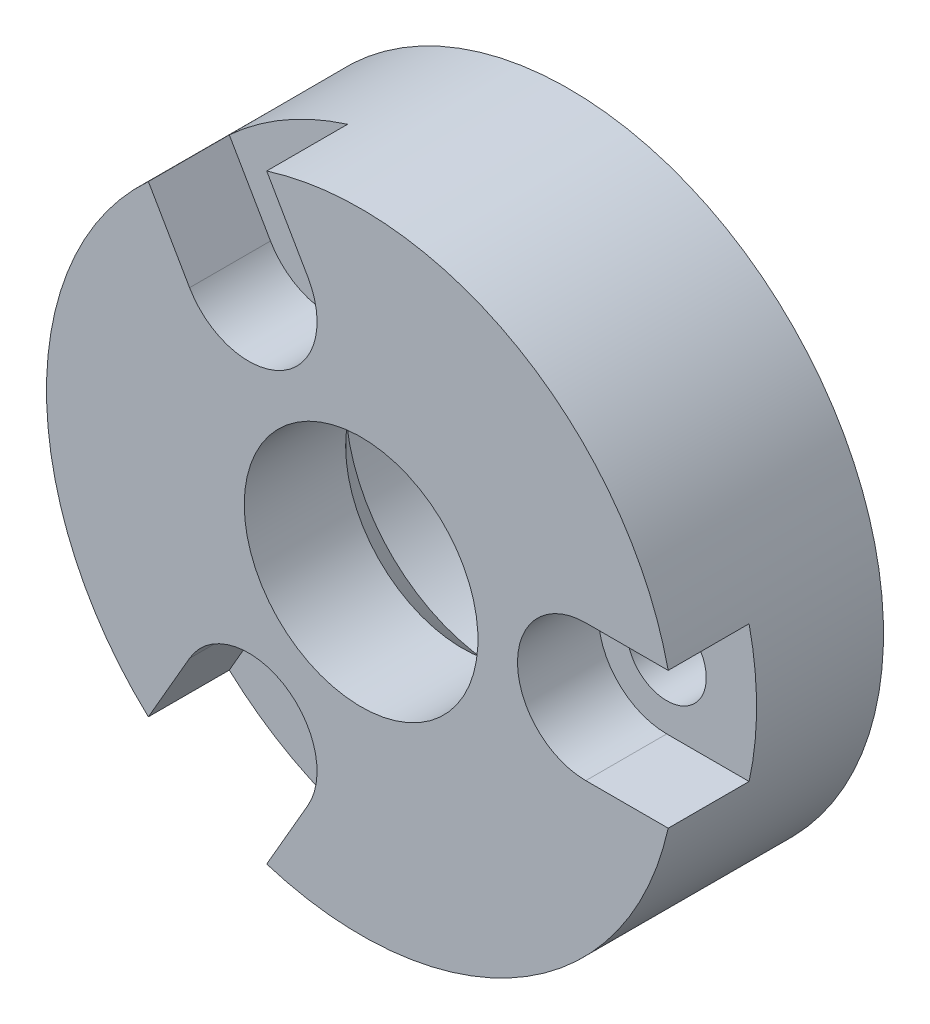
ISO-10303-21;
HEADER;
FILE_DESCRIPTION(('STEP AP214'),'2;1');
FILE_NAME('part.step','',(''),(''),'','','');
FILE_SCHEMA(('AUTOMOTIVE_DESIGN { 1 0 10303 214 1 1 1 1 }'));
ENDSEC;
DATA;
#1=APPLICATION_CONTEXT('core data for automotive mechanical design processes');
#2=APPLICATION_PROTOCOL_DEFINITION('international standard','automotive_design',2000,#1);
#3=PRODUCT_CONTEXT('',#1,'mechanical');
#4=PRODUCT('Part','Part','',(#3));
#5=PRODUCT_RELATED_PRODUCT_CATEGORY('part','',(#4));
#6=PRODUCT_DEFINITION_FORMATION('','',#4);
#7=PRODUCT_DEFINITION_CONTEXT('part definition',#1,'design');
#8=PRODUCT_DEFINITION('design','',#6,#7);
#9=PRODUCT_DEFINITION_SHAPE('','',#8);
#10=(LENGTH_UNIT() NAMED_UNIT(*) SI_UNIT(.MILLI.,.METRE.));
#11=(NAMED_UNIT(*) PLANE_ANGLE_UNIT() SI_UNIT($,.RADIAN.));
#12=(NAMED_UNIT(*) SI_UNIT($,.STERADIAN.) SOLID_ANGLE_UNIT());
#13=UNCERTAINTY_MEASURE_WITH_UNIT(LENGTH_MEASURE(1.E-05),#10,'distance_accuracy_value','');
#14=(GEOMETRIC_REPRESENTATION_CONTEXT(3) GLOBAL_UNCERTAINTY_ASSIGNED_CONTEXT((#13)) GLOBAL_UNIT_ASSIGNED_CONTEXT((#10,
#11,#12)) REPRESENTATION_CONTEXT('',''));
#15=CARTESIAN_POINT('',(0.,0.,0.));
#16=DIRECTION('',(0.,0.,1.));
#17=DIRECTION('',(1.,0.,0.));
#18=AXIS2_PLACEMENT_3D('',#15,#16,#17);
#19=CARTESIAN_POINT('',(0.,0.,40.));
#20=DIRECTION('',(0.,0.,1.));
#21=DIRECTION('',(0.49999999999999,0.866025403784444,0.));
#22=AXIS2_PLACEMENT_3D('',#19,#20,#21);
#23=CYLINDRICAL_SURFACE('',#22,17.5);
#24=CARTESIAN_POINT('',(0.,0.,0.));
#25=DIRECTION('',(0.,0.,1.));
#26=DIRECTION('',(0.49999999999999,0.866025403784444,0.));
#27=AXIS2_PLACEMENT_3D('',#24,#25,#26);
#28=CIRCLE('',#27,17.5);
#29=CARTESIAN_POINT('',(8.74999999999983,15.1554445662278,0.));
#30=VERTEX_POINT('',#29);
#31=EDGE_CURVE('E9',#30,#30,#28,.T.);
#32=ORIENTED_EDGE('',*,*,#31,.T.);
#33=EDGE_LOOP('',(#32));
#34=FACE_BOUND('',#33,.T.);
#35=DIRECTION('',(0.,0.,1.));
#36=VECTOR('',#35,1.);
#37=CARTESIAN_POINT('',(17.0824471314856,3.80000000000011,7.06));
#38=LINE('',#37,#36);
#39=CARTESIAN_POINT('',(17.0824471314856,3.80000000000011,7.06));
#40=VERTEX_POINT('',#39);
#41=CARTESIAN_POINT('',(17.0824471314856,3.80000000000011,11.56));
#42=VERTEX_POINT('',#41);
#43=EDGE_CURVE('E103',#40,#42,#38,.T.);
#44=ORIENTED_EDGE('',*,*,#43,.F.);
#45=CARTESIAN_POINT('',(0.,0.,7.06));
#46=DIRECTION('',(0.,0.,1.));
#47=DIRECTION('',(-1.,0.,0.));
#48=AXIS2_PLACEMENT_3D('',#45,#46,#47);
#49=CIRCLE('',#48,17.5);
#50=CARTESIAN_POINT('',(17.0824471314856,-3.8,7.06));
#51=VERTEX_POINT('',#50);
#52=EDGE_CURVE('E321',#51,#40,#49,.T.);
#53=ORIENTED_EDGE('',*,*,#52,.F.);
#54=DIRECTION('',(0.,0.,1.));
#55=VECTOR('',#54,1.);
#56=CARTESIAN_POINT('',(17.0824471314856,-3.8,7.06));
#57=LINE('',#56,#55);
#58=CARTESIAN_POINT('',(17.0824471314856,-3.8,11.56));
#59=VERTEX_POINT('',#58);
#60=EDGE_CURVE('E112',#51,#59,#57,.T.);
#61=ORIENTED_EDGE('',*,*,#60,.T.);
#62=CARTESIAN_POINT('',(0.,0.,11.56));
#63=DIRECTION('',(0.,0.,1.));
#64=DIRECTION('',(0.49999999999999,0.866025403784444,0.));
#65=AXIS2_PLACEMENT_3D('',#62,#63,#64);
#66=CIRCLE('',#65,17.5);
#67=CARTESIAN_POINT('',(-5.25032703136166,-16.6938331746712,11.56));
#68=VERTEX_POINT('',#67);
#69=EDGE_CURVE('E23',#68,#59,#66,.T.);
#70=ORIENTED_EDGE('',*,*,#69,.F.);
#71=DIRECTION('',(0.,0.,1.));
#72=VECTOR('',#71,1.);
#73=CARTESIAN_POINT('',(-5.25032703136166,-16.6938331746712,7.06));
#74=LINE('',#73,#72);
#75=CARTESIAN_POINT('',(-5.25032703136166,-16.6938331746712,7.06));
#76=VERTEX_POINT('',#75);
#77=EDGE_CURVE('E177',#76,#68,#74,.T.);
#78=ORIENTED_EDGE('',*,*,#77,.F.);
#79=CARTESIAN_POINT('',(0.,0.,7.06));
#80=DIRECTION('',(0.,0.,1.));
#81=DIRECTION('',(0.49999999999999,0.866025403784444,0.));
#82=AXIS2_PLACEMENT_3D('',#79,#80,#81);
#83=CIRCLE('',#82,17.5);
#84=CARTESIAN_POINT('',(-11.8321201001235,-12.8938331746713,7.06));
#85=VERTEX_POINT('',#84);
#86=EDGE_CURVE('E165',#85,#76,#83,.T.);
#87=ORIENTED_EDGE('',*,*,#86,.F.);
#88=DIRECTION('',(0.,0.,1.));
#89=VECTOR('',#88,1.);
#90=CARTESIAN_POINT('',(-11.8321201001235,-12.8938331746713,7.06));
#91=LINE('',#90,#89);
#92=CARTESIAN_POINT('',(-11.8321201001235,-12.8938331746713,11.56));
#93=VERTEX_POINT('',#92);
#94=EDGE_CURVE('E174',#85,#93,#91,.T.);
#95=ORIENTED_EDGE('',*,*,#94,.T.);
#96=CARTESIAN_POINT('',(-11.8321201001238,12.893833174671,11.56));
#97=VERTEX_POINT('',#96);
#98=EDGE_CURVE('E127',#97,#93,#66,.T.);
#99=ORIENTED_EDGE('',*,*,#98,.F.);
#100=DIRECTION('',(0.,0.,1.));
#101=VECTOR('',#100,1.);
#102=CARTESIAN_POINT('',(-11.8321201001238,12.893833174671,7.06));
#103=LINE('',#102,#101);
#104=CARTESIAN_POINT('',(-11.8321201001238,12.893833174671,7.06));
#105=VERTEX_POINT('',#104);
#106=EDGE_CURVE('E147',#105,#97,#103,.T.);
#107=ORIENTED_EDGE('',*,*,#106,.F.);
#108=CARTESIAN_POINT('',(0.,0.,7.06));
#109=DIRECTION('',(0.,0.,1.));
#110=DIRECTION('',(0.500000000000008,-0.866025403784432,0.));
#111=AXIS2_PLACEMENT_3D('',#108,#109,#110);
#112=CIRCLE('',#111,17.5);
#113=CARTESIAN_POINT('',(-5.25032703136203,16.6938331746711,7.06));
#114=VERTEX_POINT('',#113);
#115=EDGE_CURVE('E299',#114,#105,#112,.T.);
#116=ORIENTED_EDGE('',*,*,#115,.F.);
#117=DIRECTION('',(0.,0.,1.));
#118=VECTOR('',#117,1.);
#119=CARTESIAN_POINT('',(-5.25032703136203,16.6938331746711,7.06));
#120=LINE('',#119,#118);
#121=CARTESIAN_POINT('',(-5.25032703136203,16.6938331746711,11.56));
#122=VERTEX_POINT('',#121);
#123=EDGE_CURVE('E126',#114,#122,#120,.T.);
#124=ORIENTED_EDGE('',*,*,#123,.T.);
#125=EDGE_CURVE('E118',#42,#122,#66,.T.);
#126=ORIENTED_EDGE('',*,*,#125,.F.);
#127=EDGE_LOOP('',(#44,#53,#61,#70,#78,#87,#95,#99,#107,#116,#124,#126));
#128=FACE_BOUND('',#127,.T.);
#129=ADVANCED_FACE('F14',(#34,#128),#23,.T.);
#130=CARTESIAN_POINT('',(-15.1554445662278,8.74999999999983,11.56));
#131=DIRECTION('',(0.,0.,-1.));
#132=DIRECTION('',(-0.49999999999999,-0.866025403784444,0.));
#133=AXIS2_PLACEMENT_3D('',#130,#131,#132);
#134=PLANE('',#133);
#135=CARTESIAN_POINT('',(0.,0.,11.56));
#136=DIRECTION('',(0.,0.,1.));
#137=DIRECTION('',(0.49999999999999,0.866025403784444,0.));
#138=AXIS2_PLACEMENT_3D('',#135,#136,#137);
#139=CIRCLE('',#138,6.5);
#140=CARTESIAN_POINT('',(3.24999999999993,5.62916512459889,11.56));
#141=VERTEX_POINT('',#140);
#142=EDGE_CURVE('E130',#141,#141,#139,.T.);
#143=ORIENTED_EDGE('',*,*,#142,.F.);
#144=EDGE_LOOP('',(#143));
#145=FACE_BOUND('',#144,.T.);
#146=DIRECTION('',(1.,0.,0.));
#147=VECTOR('',#146,1.);
#148=CARTESIAN_POINT('',(12.5,3.8,11.56));
#149=LINE('',#148,#147);
#150=CARTESIAN_POINT('',(12.5,3.8,11.56));
#151=VERTEX_POINT('',#150);
#152=EDGE_CURVE('E31',#151,#42,#149,.T.);
#153=ORIENTED_EDGE('',*,*,#152,.T.);
#154=ORIENTED_EDGE('',*,*,#125,.T.);
#155=DIRECTION('',(-0.500000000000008,0.866025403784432,0.));
#156=VECTOR('',#155,1.);
#157=CARTESIAN_POINT('',(-2.95910346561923,12.7253175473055,11.56));
#158=LINE('',#157,#156);
#159=CARTESIAN_POINT('',(-2.95910346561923,12.7253175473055,11.56));
#160=VERTEX_POINT('',#159);
#161=EDGE_CURVE('E293',#160,#122,#158,.T.);
#162=ORIENTED_EDGE('',*,*,#161,.F.);
#163=CARTESIAN_POINT('',(-6.25000000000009,10.8253175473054,11.56));
#164=DIRECTION('',(0.,0.,-1.));
#165=DIRECTION('',(-0.500000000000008,0.866025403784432,0.));
#166=AXIS2_PLACEMENT_3D('',#163,#164,#165);
#167=CIRCLE('',#166,3.8);
#168=CARTESIAN_POINT('',(-9.54089653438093,8.92531754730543,11.56));
#169=VERTEX_POINT('',#168);
#170=EDGE_CURVE('E287',#160,#169,#167,.T.);
#171=ORIENTED_EDGE('',*,*,#170,.T.);
#172=DIRECTION('',(-0.500000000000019,0.866025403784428,0.));
#173=VECTOR('',#172,1.);
#174=CARTESIAN_POINT('',(-9.54089653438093,8.92531754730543,11.56));
#175=LINE('',#174,#173);
#176=EDGE_CURVE('E39',#169,#97,#175,.T.);
#177=ORIENTED_EDGE('',*,*,#176,.T.);
#178=ORIENTED_EDGE('',*,*,#98,.T.);
#179=DIRECTION('',(-0.49999999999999,-0.866025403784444,0.));
#180=VECTOR('',#179,1.);
#181=CARTESIAN_POINT('',(-9.54089653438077,-8.92531754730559,11.56));
#182=LINE('',#181,#180);
#183=CARTESIAN_POINT('',(-9.54089653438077,-8.92531754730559,11.56));
#184=VERTEX_POINT('',#183);
#185=EDGE_CURVE('E157',#184,#93,#182,.T.);
#186=ORIENTED_EDGE('',*,*,#185,.F.);
#187=CARTESIAN_POINT('',(-6.24999999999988,-10.8253175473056,11.56));
#188=DIRECTION('',(0.,0.,-1.));
#189=DIRECTION('',(-0.49999999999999,-0.866025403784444,0.));
#190=AXIS2_PLACEMENT_3D('',#187,#188,#189);
#191=CIRCLE('',#190,3.8);
#192=CARTESIAN_POINT('',(-2.95910346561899,-12.7253175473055,11.56));
#193=VERTEX_POINT('',#192);
#194=EDGE_CURVE('E140',#184,#193,#191,.T.);
#195=ORIENTED_EDGE('',*,*,#194,.T.);
#196=DIRECTION('',(-0.499999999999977,-0.866025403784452,0.));
#197=VECTOR('',#196,1.);
#198=CARTESIAN_POINT('',(-2.95910346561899,-12.7253175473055,11.56));
#199=LINE('',#198,#197);
#200=EDGE_CURVE('E145',#193,#68,#199,.T.);
#201=ORIENTED_EDGE('',*,*,#200,.T.);
#202=ORIENTED_EDGE('',*,*,#69,.T.);
#203=DIRECTION('',(1.,0.,0.));
#204=VECTOR('',#203,1.);
#205=CARTESIAN_POINT('',(12.5,-3.8,11.56));
#206=LINE('',#205,#204);
#207=CARTESIAN_POINT('',(12.5,-3.8,11.56));
#208=VERTEX_POINT('',#207);
#209=EDGE_CURVE('E122',#208,#59,#206,.T.);
#210=ORIENTED_EDGE('',*,*,#209,.F.);
#211=CARTESIAN_POINT('',(12.5,0.,11.56));
#212=DIRECTION('',(0.,0.,-1.));
#213=DIRECTION('',(1.,0.,0.));
#214=AXIS2_PLACEMENT_3D('',#211,#212,#213);
#215=CIRCLE('',#214,3.8);
#216=EDGE_CURVE('E121',#208,#151,#215,.T.);
#217=ORIENTED_EDGE('',*,*,#216,.T.);
#218=EDGE_LOOP('',(#153,#154,#162,#171,#177,#178,#186,#195,#201,#202,#210,#217));
#219=FACE_BOUND('',#218,.T.);
#220=ADVANCED_FACE('F116',(#145,#219),#134,.F.);
#221=CARTESIAN_POINT('',(-7.49111974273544,4.32499999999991,0.));
#222=DIRECTION('',(0.,0.,1.));
#223=DIRECTION('',(0.49999999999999,0.866025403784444,0.));
#224=AXIS2_PLACEMENT_3D('',#221,#222,#223);
#225=PLANE('',#224);
#226=CARTESIAN_POINT('',(12.5,0.,0.));
#227=DIRECTION('',(0.,0.,1.));
#228=DIRECTION('',(-1.,0.,0.));
#229=AXIS2_PLACEMENT_3D('',#226,#227,#228);
#230=CIRCLE('',#229,2.2);
#231=CARTESIAN_POINT('',(10.3,0.,0.));
#232=VERTEX_POINT('',#231);
#233=EDGE_CURVE('E136',#232,#232,#230,.T.);
#234=ORIENTED_EDGE('',*,*,#233,.T.);
#235=EDGE_LOOP('',(#234));
#236=FACE_BOUND('',#235,.T.);
#237=CARTESIAN_POINT('',(-6.25000000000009,10.8253175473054,0.));
#238=DIRECTION('',(0.,0.,1.));
#239=DIRECTION('',(0.500000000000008,-0.866025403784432,0.));
#240=AXIS2_PLACEMENT_3D('',#237,#238,#239);
#241=CIRCLE('',#240,2.2);
#242=CARTESIAN_POINT('',(-5.15000000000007,8.92006165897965,0.));
#243=VERTEX_POINT('',#242);
#244=EDGE_CURVE('E183',#243,#243,#241,.T.);
#245=ORIENTED_EDGE('',*,*,#244,.T.);
#246=EDGE_LOOP('',(#245));
#247=FACE_BOUND('',#246,.T.);
#248=CARTESIAN_POINT('',(-6.24999999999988,-10.8253175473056,0.));
#249=DIRECTION('',(0.,0.,1.));
#250=DIRECTION('',(0.49999999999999,0.866025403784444,0.));
#251=AXIS2_PLACEMENT_3D('',#248,#249,#250);
#252=CIRCLE('',#251,2.2);
#253=CARTESIAN_POINT('',(-5.1499999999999,-8.92006165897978,0.));
#254=VERTEX_POINT('',#253);
#255=EDGE_CURVE('E186',#254,#254,#252,.T.);
#256=ORIENTED_EDGE('',*,*,#255,.T.);
#257=EDGE_LOOP('',(#256));
#258=FACE_BOUND('',#257,.T.);
#259=ORIENTED_EDGE('',*,*,#31,.F.);
#260=EDGE_LOOP('',(#259));
#261=FACE_BOUND('',#260,.T.);
#262=CARTESIAN_POINT('',(0.,0.,0.));
#263=DIRECTION('',(0.,0.,1.));
#264=DIRECTION('',(0.49999999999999,0.866025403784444,0.));
#265=AXIS2_PLACEMENT_3D('',#262,#263,#264);
#266=CIRCLE('',#265,8.65);
#267=CARTESIAN_POINT('',(4.32499999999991,7.49111974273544,0.));
#268=VERTEX_POINT('',#267);
#269=EDGE_CURVE('E189',#268,#268,#266,.T.);
#270=ORIENTED_EDGE('',*,*,#269,.T.);
#271=EDGE_LOOP('',(#270));
#272=FACE_BOUND('',#271,.T.);
#273=ADVANCED_FACE('F16',(#236,#247,#258,#261,#272),#225,.F.);
#274=CARTESIAN_POINT('',(0.,0.,40.));
#275=DIRECTION('',(0.,0.,1.));
#276=DIRECTION('',(0.49999999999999,0.866025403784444,0.));
#277=AXIS2_PLACEMENT_3D('',#274,#275,#276);
#278=CYLINDRICAL_SURFACE('',#277,6.5);
#279=CARTESIAN_POINT('',(0.,0.,5.92));
#280=DIRECTION('',(0.,0.,1.));
#281=DIRECTION('',(0.49999999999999,0.866025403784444,0.));
#282=AXIS2_PLACEMENT_3D('',#279,#280,#281);
#283=CIRCLE('',#282,6.5);
#284=CARTESIAN_POINT('',(3.24999999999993,5.62916512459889,5.92));
#285=VERTEX_POINT('',#284);
#286=EDGE_CURVE('E194',#285,#285,#283,.T.);
#287=ORIENTED_EDGE('',*,*,#286,.F.);
#288=EDGE_LOOP('',(#287));
#289=FACE_BOUND('',#288,.T.);
#290=ORIENTED_EDGE('',*,*,#142,.T.);
#291=EDGE_LOOP('',(#290));
#292=FACE_BOUND('',#291,.T.);
#293=ADVANCED_FACE('F201',(#289,#292),#278,.F.);
#294=CARTESIAN_POINT('',(0.,0.,5.92));
#295=DIRECTION('',(0.,0.,-1.));
#296=DIRECTION('',(-0.49999999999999,-0.866025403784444,0.));
#297=AXIS2_PLACEMENT_3D('',#294,#295,#296);
#298=CONICAL_SURFACE('',#297,6.5,0.785398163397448);
#299=CARTESIAN_POINT('',(0.,0.,3.77));
#300=DIRECTION('',(0.,0.,1.));
#301=DIRECTION('',(0.49999999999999,0.866025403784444,0.));
#302=AXIS2_PLACEMENT_3D('',#299,#300,#301);
#303=CIRCLE('',#302,8.65);
#304=CARTESIAN_POINT('',(4.32499999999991,7.49111974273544,3.77));
#305=VERTEX_POINT('',#304);
#306=EDGE_CURVE('E192',#305,#305,#303,.T.);
#307=ORIENTED_EDGE('',*,*,#306,.F.);
#308=EDGE_LOOP('',(#307));
#309=FACE_BOUND('',#308,.T.);
#310=ORIENTED_EDGE('',*,*,#286,.T.);
#311=EDGE_LOOP('',(#310));
#312=FACE_BOUND('',#311,.T.);
#313=ADVANCED_FACE('F215',(#309,#312),#298,.F.);
#314=CARTESIAN_POINT('',(0.,0.,40.));
#315=DIRECTION('',(0.,0.,1.));
#316=DIRECTION('',(0.49999999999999,0.866025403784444,0.));
#317=AXIS2_PLACEMENT_3D('',#314,#315,#316);
#318=CYLINDRICAL_SURFACE('',#317,8.65);
#319=ORIENTED_EDGE('',*,*,#269,.F.);
#320=EDGE_LOOP('',(#319));
#321=FACE_BOUND('',#320,.T.);
#322=ORIENTED_EDGE('',*,*,#306,.T.);
#323=EDGE_LOOP('',(#322));
#324=FACE_BOUND('',#323,.T.);
#325=ADVANCED_FACE('F219',(#321,#324),#318,.F.);
#326=CARTESIAN_POINT('',(-6.24999999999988,-10.8253175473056,0.));
#327=DIRECTION('',(0.,0.,1.));
#328=DIRECTION('',(0.49999999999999,0.866025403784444,0.));
#329=AXIS2_PLACEMENT_3D('',#326,#327,#328);
#330=CYLINDRICAL_SURFACE('',#329,2.2);
#331=CARTESIAN_POINT('',(-6.24999999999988,-10.8253175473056,7.06));
#332=DIRECTION('',(0.,0.,-1.));
#333=DIRECTION('',(-0.49999999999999,-0.866025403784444,0.));
#334=AXIS2_PLACEMENT_3D('',#331,#332,#333);
#335=CIRCLE('',#334,2.2);
#336=CARTESIAN_POINT('',(-7.34999999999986,-12.7305734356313,7.06));
#337=VERTEX_POINT('',#336);
#338=EDGE_CURVE('E134',#337,#337,#335,.F.);
#339=ORIENTED_EDGE('',*,*,#338,.T.);
#340=EDGE_LOOP('',(#339));
#341=FACE_BOUND('',#340,.T.);
#342=ORIENTED_EDGE('',*,*,#255,.F.);
#343=EDGE_LOOP('',(#342));
#344=FACE_BOUND('',#343,.T.);
#345=ADVANCED_FACE('F223',(#341,#344),#330,.F.);
#346=CARTESIAN_POINT('',(-6.25000000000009,10.8253175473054,0.));
#347=DIRECTION('',(0.,0.,1.));
#348=DIRECTION('',(0.49999999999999,0.866025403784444,0.));
#349=AXIS2_PLACEMENT_3D('',#346,#347,#348);
#350=CYLINDRICAL_SURFACE('',#349,2.2);
#351=CARTESIAN_POINT('',(-6.25000000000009,10.8253175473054,7.06));
#352=DIRECTION('',(0.,0.,-1.));
#353=DIRECTION('',(-0.49999999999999,-0.866025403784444,0.));
#354=AXIS2_PLACEMENT_3D('',#351,#352,#353);
#355=CIRCLE('',#354,2.2);
#356=CARTESIAN_POINT('',(-7.35000000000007,8.92006165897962,7.06));
#357=VERTEX_POINT('',#356);
#358=EDGE_CURVE('E138',#357,#357,#355,.F.);
#359=ORIENTED_EDGE('',*,*,#358,.T.);
#360=EDGE_LOOP('',(#359));
#361=FACE_BOUND('',#360,.T.);
#362=ORIENTED_EDGE('',*,*,#244,.F.);
#363=EDGE_LOOP('',(#362));
#364=FACE_BOUND('',#363,.T.);
#365=ADVANCED_FACE('F227',(#361,#364),#350,.F.);
#366=CARTESIAN_POINT('',(12.5,0.,0.));
#367=DIRECTION('',(0.,0.,1.));
#368=DIRECTION('',(0.49999999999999,0.866025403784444,0.));
#369=AXIS2_PLACEMENT_3D('',#366,#367,#368);
#370=CYLINDRICAL_SURFACE('',#369,2.2);
#371=CARTESIAN_POINT('',(12.5,0.,7.06));
#372=DIRECTION('',(0.,0.,-1.));
#373=DIRECTION('',(-0.49999999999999,-0.866025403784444,0.));
#374=AXIS2_PLACEMENT_3D('',#371,#372,#373);
#375=CIRCLE('',#374,2.2);
#376=CARTESIAN_POINT('',(11.4,-1.90525588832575,7.06));
#377=VERTEX_POINT('',#376);
#378=EDGE_CURVE('E18',#377,#377,#375,.F.);
#379=ORIENTED_EDGE('',*,*,#378,.T.);
#380=EDGE_LOOP('',(#379));
#381=FACE_BOUND('',#380,.T.);
#382=ORIENTED_EDGE('',*,*,#233,.F.);
#383=EDGE_LOOP('',(#382));
#384=FACE_BOUND('',#383,.T.);
#385=ADVANCED_FACE('F231',(#381,#384),#370,.F.);
#386=CARTESIAN_POINT('',(-6.24999999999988,-10.8253175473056,7.06));
#387=DIRECTION('',(0.,0.,-1.));
#388=DIRECTION('',(-0.49999999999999,-0.866025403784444,0.));
#389=AXIS2_PLACEMENT_3D('',#386,#387,#388);
#390=PLANE('',#389);
#391=CARTESIAN_POINT('',(-6.24999999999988,-10.8253175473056,7.06));
#392=DIRECTION('',(0.,0.,-1.));
#393=DIRECTION('',(-0.49999999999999,-0.866025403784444,0.));
#394=AXIS2_PLACEMENT_3D('',#391,#392,#393);
#395=CIRCLE('',#394,3.8);
#396=CARTESIAN_POINT('',(-9.54089653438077,-8.92531754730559,7.06));
#397=VERTEX_POINT('',#396);
#398=CARTESIAN_POINT('',(-2.95910346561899,-12.7253175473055,7.06));
#399=VERTEX_POINT('',#398);
#400=EDGE_CURVE('E160',#397,#399,#395,.T.);
#401=ORIENTED_EDGE('',*,*,#400,.F.);
#402=DIRECTION('',(-0.49999999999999,-0.866025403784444,0.));
#403=VECTOR('',#402,1.);
#404=CARTESIAN_POINT('',(-9.54089653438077,-8.92531754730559,7.06));
#405=LINE('',#404,#403);
#406=EDGE_CURVE('E168',#397,#85,#405,.T.);
#407=ORIENTED_EDGE('',*,*,#406,.T.);
#408=ORIENTED_EDGE('',*,*,#86,.T.);
#409=DIRECTION('',(-0.499999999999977,-0.866025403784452,0.));
#410=VECTOR('',#409,1.);
#411=CARTESIAN_POINT('',(-2.95910346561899,-12.7253175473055,7.06));
#412=LINE('',#411,#410);
#413=EDGE_CURVE('E163',#399,#76,#412,.T.);
#414=ORIENTED_EDGE('',*,*,#413,.F.);
#415=EDGE_LOOP('',(#401,#407,#408,#414));
#416=FACE_BOUND('',#415,.T.);
#417=ORIENTED_EDGE('',*,*,#338,.F.);
#418=EDGE_LOOP('',(#417));
#419=FACE_BOUND('',#418,.T.);
#420=ADVANCED_FACE('F234',(#416,#419),#390,.F.);
#421=CARTESIAN_POINT('',(-2.95910346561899,-12.7253175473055,7.06));
#422=DIRECTION('',(-0.866025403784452,0.499999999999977,0.));
#423=DIRECTION('',(-0.499999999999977,-0.866025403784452,0.));
#424=AXIS2_PLACEMENT_3D('',#421,#422,#423);
#425=PLANE('',#424);
#426=ORIENTED_EDGE('',*,*,#77,.T.);
#427=ORIENTED_EDGE('',*,*,#200,.F.);
#428=DIRECTION('',(0.,0.,1.));
#429=VECTOR('',#428,1.);
#430=CARTESIAN_POINT('',(-2.95910346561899,-12.7253175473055,7.06));
#431=LINE('',#430,#429);
#432=EDGE_CURVE('E137',#399,#193,#431,.T.);
#433=ORIENTED_EDGE('',*,*,#432,.F.);
#434=ORIENTED_EDGE('',*,*,#413,.T.);
#435=EDGE_LOOP('',(#426,#427,#433,#434));
#436=FACE_BOUND('',#435,.T.);
#437=ADVANCED_FACE('F236',(#436),#425,.T.);
#438=CARTESIAN_POINT('',(-9.54089653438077,-8.92531754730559,7.06));
#439=DIRECTION('',(-0.866025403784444,0.49999999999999,0.));
#440=DIRECTION('',(-0.49999999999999,-0.866025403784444,0.));
#441=AXIS2_PLACEMENT_3D('',#438,#439,#440);
#442=PLANE('',#441);
#443=DIRECTION('',(0.,0.,1.));
#444=VECTOR('',#443,1.);
#445=CARTESIAN_POINT('',(-9.54089653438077,-8.92531754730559,7.06));
#446=LINE('',#445,#444);
#447=EDGE_CURVE('E171',#397,#184,#446,.T.);
#448=ORIENTED_EDGE('',*,*,#447,.T.);
#449=ORIENTED_EDGE('',*,*,#185,.T.);
#450=ORIENTED_EDGE('',*,*,#94,.F.);
#451=ORIENTED_EDGE('',*,*,#406,.F.);
#452=EDGE_LOOP('',(#448,#449,#450,#451));
#453=FACE_BOUND('',#452,.T.);
#454=ADVANCED_FACE('F239',(#453),#442,.F.);
#455=CARTESIAN_POINT('',(-6.24999999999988,-10.8253175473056,7.06));
#456=DIRECTION('',(0.,0.,1.));
#457=DIRECTION('',(0.49999999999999,0.866025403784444,0.));
#458=AXIS2_PLACEMENT_3D('',#455,#456,#457);
#459=CYLINDRICAL_SURFACE('',#458,3.8);
#460=ORIENTED_EDGE('',*,*,#400,.T.);
#461=ORIENTED_EDGE('',*,*,#432,.T.);
#462=ORIENTED_EDGE('',*,*,#194,.F.);
#463=ORIENTED_EDGE('',*,*,#447,.F.);
#464=EDGE_LOOP('',(#460,#461,#462,#463));
#465=FACE_BOUND('',#464,.T.);
#466=ADVANCED_FACE('F243',(#465),#459,.F.);
#467=CARTESIAN_POINT('',(-6.25000000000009,10.8253175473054,7.06));
#468=DIRECTION('',(0.,0.,-1.));
#469=DIRECTION('',(-0.500000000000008,0.866025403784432,0.));
#470=AXIS2_PLACEMENT_3D('',#467,#468,#469);
#471=PLANE('',#470);
#472=CARTESIAN_POINT('',(-6.25000000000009,10.8253175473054,7.06));
#473=DIRECTION('',(0.,0.,-1.));
#474=DIRECTION('',(-0.500000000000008,0.866025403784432,0.));
#475=AXIS2_PLACEMENT_3D('',#472,#473,#474);
#476=CIRCLE('',#475,3.8);
#477=CARTESIAN_POINT('',(-2.95910346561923,12.7253175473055,7.06));
#478=VERTEX_POINT('',#477);
#479=CARTESIAN_POINT('',(-9.54089653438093,8.92531754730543,7.06));
#480=VERTEX_POINT('',#479);
#481=EDGE_CURVE('E295',#478,#480,#476,.T.);
#482=ORIENTED_EDGE('',*,*,#481,.F.);
#483=DIRECTION('',(-0.500000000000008,0.866025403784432,0.));
#484=VECTOR('',#483,1.);
#485=CARTESIAN_POINT('',(-2.95910346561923,12.7253175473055,7.06));
#486=LINE('',#485,#484);
#487=EDGE_CURVE('E302',#478,#114,#486,.T.);
#488=ORIENTED_EDGE('',*,*,#487,.T.);
#489=ORIENTED_EDGE('',*,*,#115,.T.);
#490=DIRECTION('',(-0.500000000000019,0.866025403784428,0.));
#491=VECTOR('',#490,1.);
#492=CARTESIAN_POINT('',(-9.54089653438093,8.92531754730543,7.06));
#493=LINE('',#492,#491);
#494=EDGE_CURVE('E297',#480,#105,#493,.T.);
#495=ORIENTED_EDGE('',*,*,#494,.F.);
#496=EDGE_LOOP('',(#482,#488,#489,#495));
#497=FACE_BOUND('',#496,.T.);
#498=ORIENTED_EDGE('',*,*,#358,.F.);
#499=EDGE_LOOP('',(#498));
#500=FACE_BOUND('',#499,.T.);
#501=ADVANCED_FACE('F247',(#497,#500),#471,.F.);
#502=CARTESIAN_POINT('',(-9.54089653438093,8.92531754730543,7.06));
#503=DIRECTION('',(0.866025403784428,0.500000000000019,0.));
#504=DIRECTION('',(-0.500000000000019,0.866025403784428,0.));
#505=AXIS2_PLACEMENT_3D('',#502,#503,#504);
#506=PLANE('',#505);
#507=ORIENTED_EDGE('',*,*,#106,.T.);
#508=ORIENTED_EDGE('',*,*,#176,.F.);
#509=DIRECTION('',(0.,0.,1.));
#510=VECTOR('',#509,1.);
#511=CARTESIAN_POINT('',(-9.54089653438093,8.92531754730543,7.06));
#512=LINE('',#511,#510);
#513=EDGE_CURVE('E141',#480,#169,#512,.T.);
#514=ORIENTED_EDGE('',*,*,#513,.F.);
#515=ORIENTED_EDGE('',*,*,#494,.T.);
#516=EDGE_LOOP('',(#507,#508,#514,#515));
#517=FACE_BOUND('',#516,.T.);
#518=ADVANCED_FACE('F252',(#517),#506,.T.);
#519=CARTESIAN_POINT('',(-2.95910346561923,12.7253175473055,7.06));
#520=DIRECTION('',(0.866025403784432,0.500000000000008,0.));
#521=DIRECTION('',(-0.500000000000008,0.866025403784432,0.));
#522=AXIS2_PLACEMENT_3D('',#519,#520,#521);
#523=PLANE('',#522);
#524=DIRECTION('',(0.,0.,1.));
#525=VECTOR('',#524,1.);
#526=CARTESIAN_POINT('',(-2.95910346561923,12.7253175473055,7.06));
#527=LINE('',#526,#525);
#528=EDGE_CURVE('E305',#478,#160,#527,.T.);
#529=ORIENTED_EDGE('',*,*,#528,.T.);
#530=ORIENTED_EDGE('',*,*,#161,.T.);
#531=ORIENTED_EDGE('',*,*,#123,.F.);
#532=ORIENTED_EDGE('',*,*,#487,.F.);
#533=EDGE_LOOP('',(#529,#530,#531,#532));
#534=FACE_BOUND('',#533,.T.);
#535=ADVANCED_FACE('F255',(#534),#523,.F.);
#536=CARTESIAN_POINT('',(-6.25000000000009,10.8253175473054,7.06));
#537=DIRECTION('',(0.,0.,1.));
#538=DIRECTION('',(0.49999999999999,0.866025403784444,0.));
#539=AXIS2_PLACEMENT_3D('',#536,#537,#538);
#540=CYLINDRICAL_SURFACE('',#539,3.8);
#541=ORIENTED_EDGE('',*,*,#481,.T.);
#542=ORIENTED_EDGE('',*,*,#513,.T.);
#543=ORIENTED_EDGE('',*,*,#170,.F.);
#544=ORIENTED_EDGE('',*,*,#528,.F.);
#545=EDGE_LOOP('',(#541,#542,#543,#544));
#546=FACE_BOUND('',#545,.T.);
#547=ADVANCED_FACE('F258',(#546),#540,.F.);
#548=CARTESIAN_POINT('',(12.5,0.,7.06));
#549=DIRECTION('',(0.,0.,-1.));
#550=DIRECTION('',(1.,0.,0.));
#551=AXIS2_PLACEMENT_3D('',#548,#549,#550);
#552=PLANE('',#551);
#553=CARTESIAN_POINT('',(12.5,0.,7.06));
#554=DIRECTION('',(0.,0.,-1.));
#555=DIRECTION('',(1.,0.,0.));
#556=AXIS2_PLACEMENT_3D('',#553,#554,#555);
#557=CIRCLE('',#556,3.8);
#558=CARTESIAN_POINT('',(12.5,-3.8,7.06));
#559=VERTEX_POINT('',#558);
#560=CARTESIAN_POINT('',(12.5,3.8,7.06));
#561=VERTEX_POINT('',#560);
#562=EDGE_CURVE('E283',#559,#561,#557,.T.);
#563=ORIENTED_EDGE('',*,*,#562,.F.);
#564=DIRECTION('',(1.,0.,0.));
#565=VECTOR('',#564,1.);
#566=CARTESIAN_POINT('',(12.5,-3.8,7.06));
#567=LINE('',#566,#565);
#568=EDGE_CURVE('E325',#559,#51,#567,.T.);
#569=ORIENTED_EDGE('',*,*,#568,.T.);
#570=ORIENTED_EDGE('',*,*,#52,.T.);
#571=DIRECTION('',(1.,0.,0.));
#572=VECTOR('',#571,1.);
#573=CARTESIAN_POINT('',(12.5,3.8,7.06));
#574=LINE('',#573,#572);
#575=EDGE_CURVE('E106',#561,#40,#574,.T.);
#576=ORIENTED_EDGE('',*,*,#575,.F.);
#577=EDGE_LOOP('',(#563,#569,#570,#576));
#578=FACE_BOUND('',#577,.T.);
#579=ORIENTED_EDGE('',*,*,#378,.F.);
#580=EDGE_LOOP('',(#579));
#581=FACE_BOUND('',#580,.T.);
#582=ADVANCED_FACE('F262',(#578,#581),#552,.F.);
#583=CARTESIAN_POINT('',(12.5,3.8,7.06));
#584=DIRECTION('',(0.,-1.,0.));
#585=DIRECTION('',(1.,0.,0.));
#586=AXIS2_PLACEMENT_3D('',#583,#584,#585);
#587=PLANE('',#586);
#588=ORIENTED_EDGE('',*,*,#43,.T.);
#589=ORIENTED_EDGE('',*,*,#152,.F.);
#590=DIRECTION('',(0.,0.,1.));
#591=VECTOR('',#590,1.);
#592=CARTESIAN_POINT('',(12.5,3.8,7.06));
#593=LINE('',#592,#591);
#594=EDGE_CURVE('E111',#561,#151,#593,.T.);
#595=ORIENTED_EDGE('',*,*,#594,.F.);
#596=ORIENTED_EDGE('',*,*,#575,.T.);
#597=EDGE_LOOP('',(#588,#589,#595,#596));
#598=FACE_BOUND('',#597,.T.);
#599=ADVANCED_FACE('F104',(#598),#587,.T.);
#600=CARTESIAN_POINT('',(12.5,-3.8,7.06));
#601=DIRECTION('',(0.,-1.,0.));
#602=DIRECTION('',(1.,0.,0.));
#603=AXIS2_PLACEMENT_3D('',#600,#601,#602);
#604=PLANE('',#603);
#605=DIRECTION('',(0.,0.,1.));
#606=VECTOR('',#605,1.);
#607=CARTESIAN_POINT('',(12.5,-3.8,7.06));
#608=LINE('',#607,#606);
#609=EDGE_CURVE('E323',#559,#208,#608,.T.);
#610=ORIENTED_EDGE('',*,*,#609,.T.);
#611=ORIENTED_EDGE('',*,*,#209,.T.);
#612=ORIENTED_EDGE('',*,*,#60,.F.);
#613=ORIENTED_EDGE('',*,*,#568,.F.);
#614=EDGE_LOOP('',(#610,#611,#612,#613));
#615=FACE_BOUND('',#614,.T.);
#616=ADVANCED_FACE('F268',(#615),#604,.F.);
#617=CARTESIAN_POINT('',(12.5,0.,7.06));
#618=DIRECTION('',(0.,0.,1.));
#619=DIRECTION('',(0.49999999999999,0.866025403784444,0.));
#620=AXIS2_PLACEMENT_3D('',#617,#618,#619);
#621=CYLINDRICAL_SURFACE('',#620,3.8);
#622=ORIENTED_EDGE('',*,*,#562,.T.);
#623=ORIENTED_EDGE('',*,*,#594,.T.);
#624=ORIENTED_EDGE('',*,*,#216,.F.);
#625=ORIENTED_EDGE('',*,*,#609,.F.);
#626=EDGE_LOOP('',(#622,#623,#624,#625));
#627=FACE_BOUND('',#626,.T.);
#628=ADVANCED_FACE('F271',(#627),#621,.F.);
#629=CLOSED_SHELL('',(#129,#220,#273,#293,#313,#325,#345,#365,#385,#420,#437,#454,#466,#501,
#518,#535,#547,#582,#599,#616,#628));
#630=MANIFOLD_SOLID_BREP('B1',#629);
#631=ADVANCED_BREP_SHAPE_REPRESENTATION('',(#18,#630),#14);
#632=SHAPE_DEFINITION_REPRESENTATION(#9,#631);
ENDSEC;
END-ISO-10303-21;
